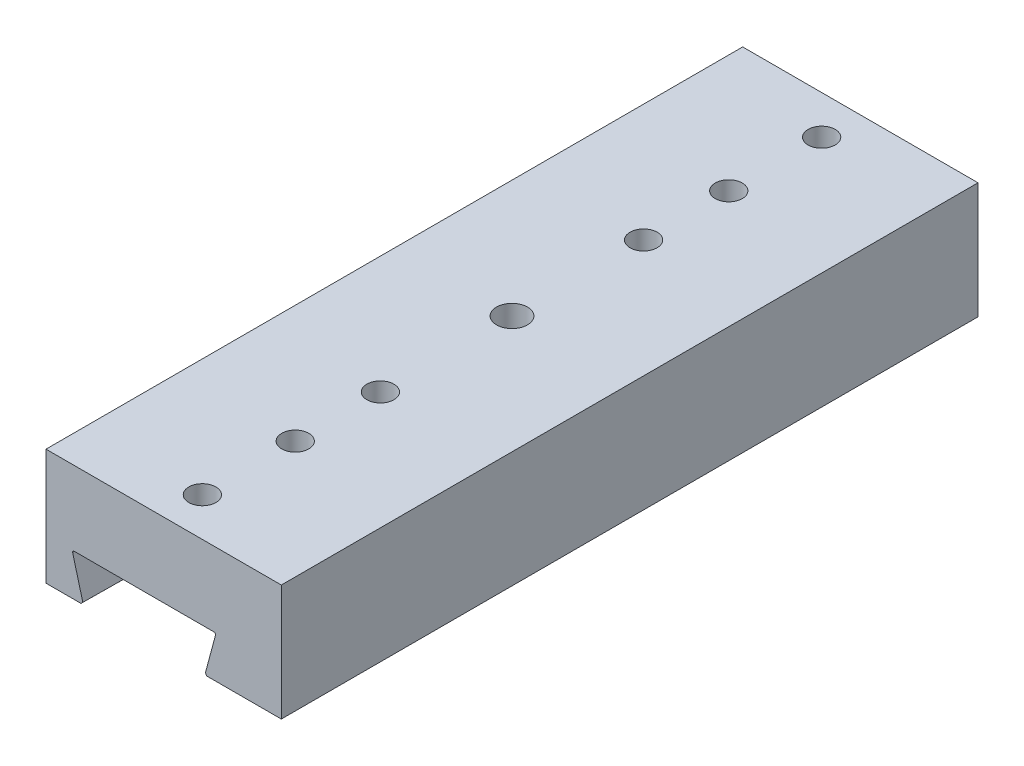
ISO-10303-21;
HEADER;
FILE_DESCRIPTION(('STEP AP214'),'2;1');
FILE_NAME('part.step','',(''),(''),'','','');
FILE_SCHEMA(('AUTOMOTIVE_DESIGN { 1 0 10303 214 1 1 1 1 }'));
ENDSEC;
DATA;
#1=APPLICATION_CONTEXT('core data for automotive mechanical design processes');
#2=APPLICATION_PROTOCOL_DEFINITION('international standard','automotive_design',2000,#1);
#3=PRODUCT_CONTEXT('',#1,'mechanical');
#4=PRODUCT('Part','Part','',(#3));
#5=PRODUCT_RELATED_PRODUCT_CATEGORY('part','',(#4));
#6=PRODUCT_DEFINITION_FORMATION('','',#4);
#7=PRODUCT_DEFINITION_CONTEXT('part definition',#1,'design');
#8=PRODUCT_DEFINITION('design','',#6,#7);
#9=PRODUCT_DEFINITION_SHAPE('','',#8);
#10=(LENGTH_UNIT() NAMED_UNIT(*) SI_UNIT(.MILLI.,.METRE.));
#11=(NAMED_UNIT(*) PLANE_ANGLE_UNIT() SI_UNIT($,.RADIAN.));
#12=(NAMED_UNIT(*) SI_UNIT($,.STERADIAN.) SOLID_ANGLE_UNIT());
#13=UNCERTAINTY_MEASURE_WITH_UNIT(LENGTH_MEASURE(1.E-05),#10,'distance_accuracy_value','');
#14=(GEOMETRIC_REPRESENTATION_CONTEXT(3) GLOBAL_UNCERTAINTY_ASSIGNED_CONTEXT((#13)) GLOBAL_UNIT_ASSIGNED_CONTEXT((#10,
#11,#12)) REPRESENTATION_CONTEXT('',''));
#15=CARTESIAN_POINT('',(0.,0.,0.));
#16=DIRECTION('',(0.,0.,1.));
#17=DIRECTION('',(1.,0.,0.));
#18=AXIS2_PLACEMENT_3D('',#15,#16,#17);
#19=CARTESIAN_POINT('',(-76.,-75.,225.));
#20=DIRECTION('',(0.,1.,0.));
#21=DIRECTION('',(0.,0.,1.));
#22=AXIS2_PLACEMENT_3D('',#19,#20,#21);
#23=PLANE('',#22);
#24=DIRECTION('',(1.,0.,0.));
#25=VECTOR('',#24,1.);
#26=CARTESIAN_POINT('',(-76.,-75.,225.));
#27=LINE('',#26,#25);
#28=CARTESIAN_POINT('',(27.8247448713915,-75.,225.));
#29=VERTEX_POINT('',#28);
#30=CARTESIAN_POINT('',(76.,-75.,225.));
#31=VERTEX_POINT('',#30);
#32=EDGE_CURVE('E144',#29,#31,#27,.T.);
#33=ORIENTED_EDGE('',*,*,#32,.F.);
#34=DIRECTION('',(0.,0.,-1.));
#35=VECTOR('',#34,1.);
#36=CARTESIAN_POINT('',(27.8247448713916,-75.,-225.));
#37=LINE('',#36,#35);
#38=CARTESIAN_POINT('',(27.8247448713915,-75.,-225.));
#39=VERTEX_POINT('',#38);
#40=EDGE_CURVE('E283',#29,#39,#37,.T.);
#41=ORIENTED_EDGE('',*,*,#40,.T.);
#42=DIRECTION('',(1.,0.,0.));
#43=VECTOR('',#42,1.);
#44=CARTESIAN_POINT('',(-76.,-75.,-225.));
#45=LINE('',#44,#43);
#46=CARTESIAN_POINT('',(76.,-75.,-225.));
#47=VERTEX_POINT('',#46);
#48=EDGE_CURVE('E173',#39,#47,#45,.T.);
#49=ORIENTED_EDGE('',*,*,#48,.T.);
#50=DIRECTION('',(0.,0.,-1.));
#51=VECTOR('',#50,1.);
#52=CARTESIAN_POINT('',(76.,-75.,225.));
#53=LINE('',#52,#51);
#54=EDGE_CURVE('E160',#31,#47,#53,.T.);
#55=ORIENTED_EDGE('',*,*,#54,.F.);
#56=EDGE_LOOP('',(#33,#41,#49,#55));
#57=FACE_BOUND('',#56,.T.);
#58=ADVANCED_FACE('F43',(#57),#23,.F.);
#59=CARTESIAN_POINT('',(-76.,-75.,-225.));
#60=VERTEX_POINT('',#59);
#61=CARTESIAN_POINT('',(-48.9000749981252,-75.,-225.));
#62=VERTEX_POINT('',#61);
#63=EDGE_CURVE('E170',#60,#62,#45,.T.);
#64=ORIENTED_EDGE('',*,*,#63,.T.);
#65=DIRECTION('',(-0.00999950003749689,0.,0.999950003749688));
#66=VECTOR('',#65,1.);
#67=CARTESIAN_POINT('',(-53.3999250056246,-75.,224.985000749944));
#68=LINE('',#67,#66);
#69=CARTESIAN_POINT('',(-53.4000749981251,-75.,225.));
#70=VERTEX_POINT('',#69);
#71=EDGE_CURVE('E141',#62,#70,#68,.T.);
#72=ORIENTED_EDGE('',*,*,#71,.T.);
#73=CARTESIAN_POINT('',(-76.,-75.,225.));
#74=VERTEX_POINT('',#73);
#75=EDGE_CURVE('E133',#74,#70,#27,.T.);
#76=ORIENTED_EDGE('',*,*,#75,.F.);
#77=DIRECTION('',(0.,0.,-1.));
#78=VECTOR('',#77,1.);
#79=CARTESIAN_POINT('',(-76.,-75.,225.));
#80=LINE('',#79,#78);
#81=EDGE_CURVE('E138',#74,#60,#80,.T.);
#82=ORIENTED_EDGE('',*,*,#81,.T.);
#83=EDGE_LOOP('',(#64,#72,#76,#82));
#84=FACE_BOUND('',#83,.T.);
#85=ADVANCED_FACE('F136',(#84),#23,.F.);
#86=CARTESIAN_POINT('',(0.,0.,225.));
#87=DIRECTION('',(0.,0.,1.));
#88=DIRECTION('',(1.,0.,0.));
#89=AXIS2_PLACEMENT_3D('',#86,#87,#88);
#90=PLANE('',#89);
#91=ORIENTED_EDGE('',*,*,#75,.T.);
#92=DIRECTION('',(0.707124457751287,0.70708910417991,0.));
#93=VECTOR('',#92,1.);
#94=CARTESIAN_POINT('',(10.8012973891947,-10.801837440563,225.));
#95=LINE('',#94,#93);
#96=CARTESIAN_POINT('',(-52.2169906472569,-73.8169747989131,225.));
#97=VERTEX_POINT('',#96);
#98=EDGE_CURVE('E285',#70,#97,#95,.T.);
#99=ORIENTED_EDGE('',*,*,#98,.T.);
#100=DIRECTION('',(0.258819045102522,-0.965925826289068,0.));
#101=VECTOR('',#100,1.);
#102=CARTESIAN_POINT('',(-59.1346281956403,-48.,225.));
#103=LINE('',#102,#101);
#104=CARTESIAN_POINT('',(-58.7973318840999,-49.2588069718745,225.));
#105=VERTEX_POINT('',#104);
#106=EDGE_CURVE('E196',#105,#97,#103,.T.);
#107=ORIENTED_EDGE('',*,*,#106,.F.);
#108=CARTESIAN_POINT('',(-57.8313545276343,-49.,225.));
#109=DIRECTION('',(0.,0.,1.));
#110=DIRECTION('',(-1.,0.,0.));
#111=AXIS2_PLACEMENT_3D('',#108,#109,#110);
#112=ELLIPSE('',#111,1.00004999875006,1.);
#113=CARTESIAN_POINT('',(-57.8313545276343,-48.,225.));
#114=VERTEX_POINT('',#113);
#115=EDGE_CURVE('E228',#105,#114,#112,.F.);
#116=ORIENTED_EDGE('',*,*,#115,.T.);
#117=DIRECTION('',(-1.,0.,0.));
#118=VECTOR('',#117,1.);
#119=CARTESIAN_POINT('',(33.8346281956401,-48.,225.));
#120=LINE('',#119,#118);
#121=CARTESIAN_POINT('',(32.5314028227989,-48.,225.));
#122=VERTEX_POINT('',#121);
#123=EDGE_CURVE('E195',#122,#114,#120,.T.);
#124=ORIENTED_EDGE('',*,*,#123,.F.);
#125=CARTESIAN_POINT('',(32.5314028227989,-49.,225.));
#126=DIRECTION('',(0.,0.,1.));
#127=DIRECTION('',(1.,0.,0.));
#128=AXIS2_PLACEMENT_3D('',#125,#126,#127);
#129=CIRCLE('',#128,1.);
#130=CARTESIAN_POINT('',(33.497328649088,-49.2588190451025,225.));
#131=VERTEX_POINT('',#130);
#132=EDGE_CURVE('E222',#122,#131,#129,.F.);
#133=ORIENTED_EDGE('',*,*,#132,.T.);
#134=DIRECTION('',(0.258819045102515,0.96592582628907,0.));
#135=VECTOR('',#134,1.);
#136=CARTESIAN_POINT('',(26.6,-75.,225.));
#137=LINE('',#136,#135);
#138=CARTESIAN_POINT('',(26.9882285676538,-73.5511112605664,225.));
#139=VERTEX_POINT('',#138);
#140=EDGE_CURVE('E192',#139,#131,#137,.T.);
#141=ORIENTED_EDGE('',*,*,#140,.F.);
#142=DIRECTION('',(0.500000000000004,-0.866025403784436,0.));
#143=VECTOR('',#142,1.);
#144=CARTESIAN_POINT('',(-11.6073939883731,-6.7015320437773,225.));
#145=LINE('',#144,#143);
#146=EDGE_CURVE('E58',#139,#29,#145,.T.);
#147=ORIENTED_EDGE('',*,*,#146,.T.);
#148=ORIENTED_EDGE('',*,*,#32,.T.);
#149=DIRECTION('',(0.,1.,0.));
#150=VECTOR('',#149,1.);
#151=CARTESIAN_POINT('',(76.,0.,225.));
#152=LINE('',#151,#150);
#153=CARTESIAN_POINT('',(76.,0.,225.));
#154=VERTEX_POINT('',#153);
#155=EDGE_CURVE('E143',#31,#154,#152,.T.);
#156=ORIENTED_EDGE('',*,*,#155,.T.);
#157=DIRECTION('',(-1.,0.,0.));
#158=VECTOR('',#157,1.);
#159=CARTESIAN_POINT('',(-76.,0.,225.));
#160=LINE('',#159,#158);
#161=CARTESIAN_POINT('',(-76.,0.,225.));
#162=VERTEX_POINT('',#161);
#163=EDGE_CURVE('E150',#154,#162,#160,.T.);
#164=ORIENTED_EDGE('',*,*,#163,.T.);
#165=DIRECTION('',(0.,-1.,0.));
#166=VECTOR('',#165,1.);
#167=CARTESIAN_POINT('',(-76.,0.,225.));
#168=LINE('',#167,#166);
#169=EDGE_CURVE('E147',#162,#74,#168,.T.);
#170=ORIENTED_EDGE('',*,*,#169,.T.);
#171=EDGE_LOOP('',(#91,#99,#107,#116,#124,#133,#141,#147,#148,#156,#164,#170));
#172=FACE_BOUND('',#171,.T.);
#173=ADVANCED_FACE('F148',(#172),#90,.T.);
#174=CARTESIAN_POINT('',(0.,0.,-225.));
#175=DIRECTION('',(0.,0.,1.));
#176=DIRECTION('',(1.,0.,0.));
#177=AXIS2_PLACEMENT_3D('',#174,#175,#176);
#178=PLANE('',#177);
#179=DIRECTION('',(-0.258819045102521,0.965925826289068,0.));
#180=VECTOR('',#179,1.);
#181=CARTESIAN_POINT('',(-54.6346281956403,-48.,-225.));
#182=LINE('',#181,#180);
#183=CARTESIAN_POINT('',(-47.7169906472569,-73.8169747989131,-225.));
#184=VERTEX_POINT('',#183);
#185=CARTESIAN_POINT('',(-54.2973318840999,-49.2588069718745,-225.));
#186=VERTEX_POINT('',#185);
#187=EDGE_CURVE('E206',#184,#186,#182,.T.);
#188=ORIENTED_EDGE('',*,*,#187,.F.);
#189=DIRECTION('',(-0.707124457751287,-0.70708910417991,0.));
#190=VECTOR('',#189,1.);
#191=CARTESIAN_POINT('',(-48.8395486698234,-74.9394766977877,-225.));
#192=LINE('',#191,#190);
#193=EDGE_CURVE('E189',#184,#62,#192,.T.);
#194=ORIENTED_EDGE('',*,*,#193,.T.);
#195=ORIENTED_EDGE('',*,*,#63,.F.);
#196=DIRECTION('',(0.,-1.,0.));
#197=VECTOR('',#196,1.);
#198=CARTESIAN_POINT('',(-76.,0.,-225.));
#199=LINE('',#198,#197);
#200=CARTESIAN_POINT('',(-76.,0.,-225.));
#201=VERTEX_POINT('',#200);
#202=EDGE_CURVE('E158',#201,#60,#199,.T.);
#203=ORIENTED_EDGE('',*,*,#202,.F.);
#204=DIRECTION('',(-1.,0.,0.));
#205=VECTOR('',#204,1.);
#206=CARTESIAN_POINT('',(-76.,0.,-225.));
#207=LINE('',#206,#205);
#208=CARTESIAN_POINT('',(76.,0.,-225.));
#209=VERTEX_POINT('',#208);
#210=EDGE_CURVE('E154',#209,#201,#207,.T.);
#211=ORIENTED_EDGE('',*,*,#210,.F.);
#212=DIRECTION('',(0.,1.,0.));
#213=VECTOR('',#212,1.);
#214=CARTESIAN_POINT('',(76.,0.,-225.));
#215=LINE('',#214,#213);
#216=EDGE_CURVE('E172',#47,#209,#215,.T.);
#217=ORIENTED_EDGE('',*,*,#216,.F.);
#218=ORIENTED_EDGE('',*,*,#48,.F.);
#219=DIRECTION('',(-0.500000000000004,0.866025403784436,0.));
#220=VECTOR('',#219,1.);
#221=CARTESIAN_POINT('',(27.8247448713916,-75.,-225.));
#222=LINE('',#221,#220);
#223=CARTESIAN_POINT('',(26.9882285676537,-73.5511112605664,-225.));
#224=VERTEX_POINT('',#223);
#225=EDGE_CURVE('E187',#39,#224,#222,.T.);
#226=ORIENTED_EDGE('',*,*,#225,.T.);
#227=DIRECTION('',(-0.258819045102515,-0.96592582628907,0.));
#228=VECTOR('',#227,1.);
#229=CARTESIAN_POINT('',(26.6,-75.,-225.));
#230=LINE('',#229,#228);
#231=CARTESIAN_POINT('',(33.497328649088,-49.2588190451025,-225.));
#232=VERTEX_POINT('',#231);
#233=EDGE_CURVE('E203',#232,#224,#230,.T.);
#234=ORIENTED_EDGE('',*,*,#233,.F.);
#235=CARTESIAN_POINT('',(32.5314028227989,-49.,-225.));
#236=DIRECTION('',(0.,0.,1.));
#237=DIRECTION('',(1.,0.,0.));
#238=AXIS2_PLACEMENT_3D('',#235,#236,#237);
#239=CIRCLE('',#238,1.);
#240=CARTESIAN_POINT('',(32.5314028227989,-48.,-225.));
#241=VERTEX_POINT('',#240);
#242=EDGE_CURVE('E220',#232,#241,#239,.T.);
#243=ORIENTED_EDGE('',*,*,#242,.T.);
#244=DIRECTION('',(1.,0.,0.));
#245=VECTOR('',#244,1.);
#246=CARTESIAN_POINT('',(33.8346281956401,-48.,-225.));
#247=LINE('',#246,#245);
#248=CARTESIAN_POINT('',(-53.3313545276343,-48.,-225.));
#249=VERTEX_POINT('',#248);
#250=EDGE_CURVE('E205',#249,#241,#247,.T.);
#251=ORIENTED_EDGE('',*,*,#250,.F.);
#252=CARTESIAN_POINT('',(-53.3313545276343,-49.,-225.));
#253=DIRECTION('',(0.,0.,1.));
#254=DIRECTION('',(-1.,0.,0.));
#255=AXIS2_PLACEMENT_3D('',#252,#253,#254);
#256=ELLIPSE('',#255,1.00004999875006,1.);
#257=EDGE_CURVE('E225',#249,#186,#256,.T.);
#258=ORIENTED_EDGE('',*,*,#257,.T.);
#259=EDGE_LOOP('',(#188,#194,#195,#203,#211,#217,#218,#226,#234,#243,#251,#258));
#260=FACE_BOUND('',#259,.T.);
#261=ADVANCED_FACE('F260',(#260),#178,.F.);
#262=CARTESIAN_POINT('',(-76.,0.,225.));
#263=DIRECTION('',(1.,0.,0.));
#264=DIRECTION('',(0.,1.,0.));
#265=AXIS2_PLACEMENT_3D('',#262,#263,#264);
#266=PLANE('',#265);
#267=ORIENTED_EDGE('',*,*,#202,.T.);
#268=ORIENTED_EDGE('',*,*,#81,.F.);
#269=ORIENTED_EDGE('',*,*,#169,.F.);
#270=DIRECTION('',(0.,0.,-1.));
#271=VECTOR('',#270,1.);
#272=CARTESIAN_POINT('',(-76.,0.,225.));
#273=LINE('',#272,#271);
#274=EDGE_CURVE('E246',#162,#201,#273,.T.);
#275=ORIENTED_EDGE('',*,*,#274,.T.);
#276=EDGE_LOOP('',(#267,#268,#269,#275));
#277=FACE_BOUND('',#276,.T.);
#278=ADVANCED_FACE('F156',(#277),#266,.F.);
#279=CARTESIAN_POINT('',(76.,0.,225.));
#280=DIRECTION('',(-1.,0.,0.));
#281=DIRECTION('',(0.,-1.,0.));
#282=AXIS2_PLACEMENT_3D('',#279,#280,#281);
#283=PLANE('',#282);
#284=ORIENTED_EDGE('',*,*,#216,.T.);
#285=DIRECTION('',(0.,0.,-1.));
#286=VECTOR('',#285,1.);
#287=CARTESIAN_POINT('',(76.,0.,225.));
#288=LINE('',#287,#286);
#289=EDGE_CURVE('E166',#154,#209,#288,.T.);
#290=ORIENTED_EDGE('',*,*,#289,.F.);
#291=ORIENTED_EDGE('',*,*,#155,.F.);
#292=ORIENTED_EDGE('',*,*,#54,.T.);
#293=EDGE_LOOP('',(#284,#290,#291,#292));
#294=FACE_BOUND('',#293,.T.);
#295=ADVANCED_FACE('F254',(#294),#283,.F.);
#296=CARTESIAN_POINT('',(-76.,0.,225.));
#297=DIRECTION('',(0.,-1.,0.));
#298=DIRECTION('',(0.,0.,-1.));
#299=AXIS2_PLACEMENT_3D('',#296,#297,#298);
#300=PLANE('',#299);
#301=CARTESIAN_POINT('',(0.,0.,0.));
#302=DIRECTION('',(0.,-1.,0.));
#303=DIRECTION('',(0.,0.,-1.));
#304=AXIS2_PLACEMENT_3D('',#301,#302,#303);
#305=CIRCLE('',#304,10.);
#306=CARTESIAN_POINT('',(0.,0.,-10.));
#307=VERTEX_POINT('',#306);
#308=EDGE_CURVE('E351',#307,#307,#305,.F.);
#309=ORIENTED_EDGE('',*,*,#308,.F.);
#310=EDGE_LOOP('',(#309));
#311=FACE_BOUND('',#310,.T.);
#312=CARTESIAN_POINT('',(0.,0.,85.));
#313=DIRECTION('',(0.,-1.,0.));
#314=DIRECTION('',(0.,0.,-1.));
#315=AXIS2_PLACEMENT_3D('',#312,#313,#314);
#316=CIRCLE('',#315,8.74999999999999);
#317=CARTESIAN_POINT('',(0.,0.,76.25));
#318=VERTEX_POINT('',#317);
#319=EDGE_CURVE('E355',#318,#318,#316,.T.);
#320=ORIENTED_EDGE('',*,*,#319,.T.);
#321=EDGE_LOOP('',(#320));
#322=FACE_BOUND('',#321,.T.);
#323=CARTESIAN_POINT('',(0.,0.,140.));
#324=DIRECTION('',(0.,-1.,0.));
#325=DIRECTION('',(0.,0.,-1.));
#326=AXIS2_PLACEMENT_3D('',#323,#324,#325);
#327=CIRCLE('',#326,8.74999999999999);
#328=CARTESIAN_POINT('',(0.,0.,131.25));
#329=VERTEX_POINT('',#328);
#330=EDGE_CURVE('E359',#329,#329,#327,.T.);
#331=ORIENTED_EDGE('',*,*,#330,.T.);
#332=EDGE_LOOP('',(#331));
#333=FACE_BOUND('',#332,.T.);
#334=CARTESIAN_POINT('',(0.,0.,200.));
#335=DIRECTION('',(0.,-1.,0.));
#336=DIRECTION('',(0.,0.,-1.));
#337=AXIS2_PLACEMENT_3D('',#334,#335,#336);
#338=CIRCLE('',#337,8.74999999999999);
#339=CARTESIAN_POINT('',(0.,0.,191.25));
#340=VERTEX_POINT('',#339);
#341=EDGE_CURVE('E363',#340,#340,#338,.T.);
#342=ORIENTED_EDGE('',*,*,#341,.T.);
#343=EDGE_LOOP('',(#342));
#344=FACE_BOUND('',#343,.T.);
#345=CARTESIAN_POINT('',(0.,0.,-200.));
#346=DIRECTION('',(0.,-1.,0.));
#347=DIRECTION('',(0.,0.,-1.));
#348=AXIS2_PLACEMENT_3D('',#345,#346,#347);
#349=CIRCLE('',#348,8.74999999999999);
#350=CARTESIAN_POINT('',(0.,0.,-208.75));
#351=VERTEX_POINT('',#350);
#352=EDGE_CURVE('E367',#351,#351,#349,.T.);
#353=ORIENTED_EDGE('',*,*,#352,.T.);
#354=EDGE_LOOP('',(#353));
#355=FACE_BOUND('',#354,.T.);
#356=CARTESIAN_POINT('',(0.,0.,-140.));
#357=DIRECTION('',(0.,-1.,0.));
#358=DIRECTION('',(0.,0.,-1.));
#359=AXIS2_PLACEMENT_3D('',#356,#357,#358);
#360=CIRCLE('',#359,8.74999999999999);
#361=CARTESIAN_POINT('',(0.,0.,-148.75));
#362=VERTEX_POINT('',#361);
#363=EDGE_CURVE('E370',#362,#362,#360,.T.);
#364=ORIENTED_EDGE('',*,*,#363,.T.);
#365=EDGE_LOOP('',(#364));
#366=FACE_BOUND('',#365,.T.);
#367=CARTESIAN_POINT('',(0.,0.,-85.));
#368=DIRECTION('',(0.,-1.,0.));
#369=DIRECTION('',(0.,0.,-1.));
#370=AXIS2_PLACEMENT_3D('',#367,#368,#369);
#371=CIRCLE('',#370,8.74999999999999);
#372=CARTESIAN_POINT('',(0.,0.,-93.75));
#373=VERTEX_POINT('',#372);
#374=EDGE_CURVE('E229',#373,#373,#371,.T.);
#375=ORIENTED_EDGE('',*,*,#374,.T.);
#376=EDGE_LOOP('',(#375));
#377=FACE_BOUND('',#376,.T.);
#378=ORIENTED_EDGE('',*,*,#210,.T.);
#379=ORIENTED_EDGE('',*,*,#274,.F.);
#380=ORIENTED_EDGE('',*,*,#163,.F.);
#381=ORIENTED_EDGE('',*,*,#289,.T.);
#382=EDGE_LOOP('',(#378,#379,#380,#381));
#383=FACE_BOUND('',#382,.T.);
#384=ADVANCED_FACE('F259',(#311,#322,#333,#344,#355,#366,#377,#383),#300,.F.);
#385=CARTESIAN_POINT('',(43.5681378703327,-11.6740473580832,0.));
#386=DIRECTION('',(-0.96592582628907,0.258819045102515,0.));
#387=DIRECTION('',(-0.258819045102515,-0.96592582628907,0.));
#388=AXIS2_PLACEMENT_3D('',#385,#386,#387);
#389=PLANE('',#388);
#390=ORIENTED_EDGE('',*,*,#233,.T.);
#391=DIRECTION('',(0.,0.,1.));
#392=VECTOR('',#391,1.);
#393=CARTESIAN_POINT('',(26.9882285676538,-73.5511112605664,225.));
#394=LINE('',#393,#392);
#395=EDGE_CURVE('E66',#224,#139,#394,.T.);
#396=ORIENTED_EDGE('',*,*,#395,.T.);
#397=ORIENTED_EDGE('',*,*,#140,.T.);
#398=DIRECTION('',(0.,0.,-1.));
#399=VECTOR('',#398,1.);
#400=CARTESIAN_POINT('',(33.497328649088,-49.2588190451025,-225.));
#401=LINE('',#400,#399);
#402=EDGE_CURVE('E159',#131,#232,#401,.T.);
#403=ORIENTED_EDGE('',*,*,#402,.T.);
#404=EDGE_LOOP('',(#390,#396,#397,#403));
#405=FACE_BOUND('',#404,.T.);
#406=ADVANCED_FACE('F278',(#405),#389,.T.);
#407=CARTESIAN_POINT('',(0.,-48.,0.));
#408=DIRECTION('',(0.,-1.,0.));
#409=DIRECTION('',(0.,0.,-1.));
#410=AXIS2_PLACEMENT_3D('',#407,#408,#409);
#411=PLANE('',#410);
#412=CARTESIAN_POINT('',(0.,-48.,0.));
#413=DIRECTION('',(0.,-1.,0.));
#414=DIRECTION('',(0.,0.,-1.));
#415=AXIS2_PLACEMENT_3D('',#412,#413,#414);
#416=CIRCLE('',#415,11.0000000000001);
#417=CARTESIAN_POINT('',(0.,-48.,-11.0000000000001));
#418=VERTEX_POINT('',#417);
#419=EDGE_CURVE('E12',#418,#418,#416,.F.);
#420=ORIENTED_EDGE('',*,*,#419,.T.);
#421=EDGE_LOOP('',(#420));
#422=FACE_BOUND('',#421,.T.);
#423=CARTESIAN_POINT('',(0.,-48.,85.));
#424=DIRECTION('',(0.,-1.,0.));
#425=DIRECTION('',(0.,0.,-1.));
#426=AXIS2_PLACEMENT_3D('',#423,#424,#425);
#427=CIRCLE('',#426,15.);
#428=CARTESIAN_POINT('',(0.,-48.,70.));
#429=VERTEX_POINT('',#428);
#430=EDGE_CURVE('E655',#429,#429,#427,.T.);
#431=ORIENTED_EDGE('',*,*,#430,.F.);
#432=EDGE_LOOP('',(#431));
#433=FACE_BOUND('',#432,.T.);
#434=CARTESIAN_POINT('',(0.,-48.,140.));
#435=DIRECTION('',(0.,-1.,0.));
#436=DIRECTION('',(0.,0.,-1.));
#437=AXIS2_PLACEMENT_3D('',#434,#435,#436);
#438=CIRCLE('',#437,15.);
#439=CARTESIAN_POINT('',(0.,-48.,125.));
#440=VERTEX_POINT('',#439);
#441=EDGE_CURVE('E665',#440,#440,#438,.T.);
#442=ORIENTED_EDGE('',*,*,#441,.F.);
#443=EDGE_LOOP('',(#442));
#444=FACE_BOUND('',#443,.T.);
#445=CARTESIAN_POINT('',(0.,-48.,200.));
#446=DIRECTION('',(0.,-1.,0.));
#447=DIRECTION('',(0.,0.,-1.));
#448=AXIS2_PLACEMENT_3D('',#445,#446,#447);
#449=CIRCLE('',#448,15.);
#450=CARTESIAN_POINT('',(0.,-48.,185.));
#451=VERTEX_POINT('',#450);
#452=EDGE_CURVE('E675',#451,#451,#449,.T.);
#453=ORIENTED_EDGE('',*,*,#452,.F.);
#454=EDGE_LOOP('',(#453));
#455=FACE_BOUND('',#454,.T.);
#456=CARTESIAN_POINT('',(0.,-48.,-200.));
#457=DIRECTION('',(0.,-1.,0.));
#458=DIRECTION('',(0.,0.,-1.));
#459=AXIS2_PLACEMENT_3D('',#456,#457,#458);
#460=CIRCLE('',#459,15.);
#461=CARTESIAN_POINT('',(0.,-48.,-215.));
#462=VERTEX_POINT('',#461);
#463=EDGE_CURVE('E685',#462,#462,#460,.T.);
#464=ORIENTED_EDGE('',*,*,#463,.F.);
#465=EDGE_LOOP('',(#464));
#466=FACE_BOUND('',#465,.T.);
#467=CARTESIAN_POINT('',(0.,-48.,-140.));
#468=DIRECTION('',(0.,-1.,0.));
#469=DIRECTION('',(0.,0.,-1.));
#470=AXIS2_PLACEMENT_3D('',#467,#468,#469);
#471=CIRCLE('',#470,15.);
#472=CARTESIAN_POINT('',(0.,-48.,-155.));
#473=VERTEX_POINT('',#472);
#474=EDGE_CURVE('E695',#473,#473,#471,.T.);
#475=ORIENTED_EDGE('',*,*,#474,.F.);
#476=EDGE_LOOP('',(#475));
#477=FACE_BOUND('',#476,.T.);
#478=CARTESIAN_POINT('',(0.,-48.,-85.));
#479=DIRECTION('',(0.,-1.,0.));
#480=DIRECTION('',(0.,0.,-1.));
#481=AXIS2_PLACEMENT_3D('',#478,#479,#480);
#482=CIRCLE('',#481,15.);
#483=CARTESIAN_POINT('',(0.,-48.,-100.));
#484=VERTEX_POINT('',#483);
#485=EDGE_CURVE('E372',#484,#484,#482,.T.);
#486=ORIENTED_EDGE('',*,*,#485,.F.);
#487=EDGE_LOOP('',(#486));
#488=FACE_BOUND('',#487,.T.);
#489=ORIENTED_EDGE('',*,*,#250,.T.);
#490=DIRECTION('',(0.,0.,-1.));
#491=VECTOR('',#490,1.);
#492=CARTESIAN_POINT('',(32.5314028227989,-48.,225.));
#493=LINE('',#492,#491);
#494=EDGE_CURVE('E216',#241,#122,#493,.F.);
#495=ORIENTED_EDGE('',*,*,#494,.T.);
#496=ORIENTED_EDGE('',*,*,#123,.T.);
#497=DIRECTION('',(0.00999950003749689,0.,-0.999950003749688));
#498=VECTOR('',#497,1.);
#499=CARTESIAN_POINT('',(-53.3314848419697,-48.,-224.986968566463));
#500=LINE('',#499,#498);
#501=EDGE_CURVE('E163',#114,#249,#500,.T.);
#502=ORIENTED_EDGE('',*,*,#501,.T.);
#503=EDGE_LOOP('',(#489,#495,#496,#502));
#504=FACE_BOUND('',#503,.T.);
#505=ADVANCED_FACE('F270',(#422,#433,#444,#455,#466,#477,#488,#504),#411,.T.);
#506=CARTESIAN_POINT('',(-65.0680097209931,-17.4349206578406,-0.650680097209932));
#507=DIRECTION('',(0.965880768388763,0.258806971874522,0.00965880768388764));
#508=DIRECTION('',(-0.258819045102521,0.965925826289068,0.));
#509=AXIS2_PLACEMENT_3D('',#506,#507,#508);
#510=PLANE('',#509);
#511=ORIENTED_EDGE('',*,*,#106,.T.);
#512=DIRECTION('',(0.00999950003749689,0.,-0.999950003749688));
#513=VECTOR('',#512,1.);
#514=CARTESIAN_POINT('',(-47.7169589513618,-73.8169747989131,-225.003169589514));
#515=LINE('',#514,#513);
#516=EDGE_CURVE('E185',#97,#184,#515,.T.);
#517=ORIENTED_EDGE('',*,*,#516,.T.);
#518=ORIENTED_EDGE('',*,*,#187,.T.);
#519=DIRECTION('',(0.00999950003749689,0.,-0.999950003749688));
#520=VECTOR('',#519,1.);
#521=CARTESIAN_POINT('',(-58.7973656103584,-49.2588069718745,225.003372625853));
#522=LINE('',#521,#520);
#523=EDGE_CURVE('E218',#186,#105,#522,.F.);
#524=ORIENTED_EDGE('',*,*,#523,.T.);
#525=EDGE_LOOP('',(#511,#517,#518,#524));
#526=FACE_BOUND('',#525,.T.);
#527=ADVANCED_FACE('F323',(#526),#510,.T.);
#528=CARTESIAN_POINT('',(0.,-48.,-85.));
#529=DIRECTION('',(0.,-1.,0.));
#530=DIRECTION('',(0.,0.,-1.));
#531=AXIS2_PLACEMENT_3D('',#528,#529,#530);
#532=CYLINDRICAL_SURFACE('',#531,8.75);
#533=ORIENTED_EDGE('',*,*,#374,.F.);
#534=EDGE_LOOP('',(#533));
#535=FACE_BOUND('',#534,.T.);
#536=CARTESIAN_POINT('',(0.,-27.4,-85.));
#537=DIRECTION('',(0.,-1.,0.));
#538=DIRECTION('',(0.,0.,-1.));
#539=AXIS2_PLACEMENT_3D('',#536,#537,#538);
#540=CIRCLE('',#539,8.75);
#541=CARTESIAN_POINT('',(0.,-27.4,-93.75));
#542=VERTEX_POINT('',#541);
#543=EDGE_CURVE('E235',#542,#542,#540,.T.);
#544=ORIENTED_EDGE('',*,*,#543,.T.);
#545=EDGE_LOOP('',(#544));
#546=FACE_BOUND('',#545,.T.);
#547=ADVANCED_FACE('F326',(#535,#546),#532,.F.);
#548=CARTESIAN_POINT('',(8.75,-27.4,-85.));
#549=DIRECTION('',(0.,1.,0.));
#550=DIRECTION('',(0.,0.,1.));
#551=AXIS2_PLACEMENT_3D('',#548,#549,#550);
#552=PLANE('',#551);
#553=ORIENTED_EDGE('',*,*,#543,.F.);
#554=EDGE_LOOP('',(#553));
#555=FACE_BOUND('',#554,.T.);
#556=CARTESIAN_POINT('',(0.,-27.4,-85.));
#557=DIRECTION('',(0.,-1.,0.));
#558=DIRECTION('',(0.,0.,-1.));
#559=AXIS2_PLACEMENT_3D('',#556,#557,#558);
#560=CIRCLE('',#559,15.);
#561=CARTESIAN_POINT('',(0.,-27.4,-100.));
#562=VERTEX_POINT('',#561);
#563=EDGE_CURVE('E240',#562,#562,#560,.T.);
#564=ORIENTED_EDGE('',*,*,#563,.T.);
#565=EDGE_LOOP('',(#564));
#566=FACE_BOUND('',#565,.T.);
#567=ADVANCED_FACE('F332',(#555,#566),#552,.F.);
#568=CARTESIAN_POINT('',(0.,-48.,-85.));
#569=DIRECTION('',(0.,-1.,0.));
#570=DIRECTION('',(0.,0.,-1.));
#571=AXIS2_PLACEMENT_3D('',#568,#569,#570);
#572=CYLINDRICAL_SURFACE('',#571,15.);
#573=ORIENTED_EDGE('',*,*,#563,.F.);
#574=EDGE_LOOP('',(#573));
#575=FACE_BOUND('',#574,.T.);
#576=ORIENTED_EDGE('',*,*,#485,.T.);
#577=EDGE_LOOP('',(#576));
#578=FACE_BOUND('',#577,.T.);
#579=ADVANCED_FACE('F385',(#575,#578),#572,.F.);
#580=CARTESIAN_POINT('',(0.,-48.,-140.));
#581=DIRECTION('',(0.,-1.,0.));
#582=DIRECTION('',(0.,0.,-1.));
#583=AXIS2_PLACEMENT_3D('',#580,#581,#582);
#584=CYLINDRICAL_SURFACE('',#583,8.75);
#585=ORIENTED_EDGE('',*,*,#363,.F.);
#586=EDGE_LOOP('',(#585));
#587=FACE_BOUND('',#586,.T.);
#588=CARTESIAN_POINT('',(0.,-27.4,-140.));
#589=DIRECTION('',(0.,-1.,0.));
#590=DIRECTION('',(0.,0.,-1.));
#591=AXIS2_PLACEMENT_3D('',#588,#589,#590);
#592=CIRCLE('',#591,8.75);
#593=CARTESIAN_POINT('',(0.,-27.4,-148.75));
#594=VERTEX_POINT('',#593);
#595=EDGE_CURVE('E373',#594,#594,#592,.T.);
#596=ORIENTED_EDGE('',*,*,#595,.T.);
#597=EDGE_LOOP('',(#596));
#598=FACE_BOUND('',#597,.T.);
#599=ADVANCED_FACE('F388',(#587,#598),#584,.F.);
#600=CARTESIAN_POINT('',(8.75,-27.4,-140.));
#601=DIRECTION('',(0.,1.,0.));
#602=DIRECTION('',(0.,0.,1.));
#603=AXIS2_PLACEMENT_3D('',#600,#601,#602);
#604=PLANE('',#603);
#605=ORIENTED_EDGE('',*,*,#595,.F.);
#606=EDGE_LOOP('',(#605));
#607=FACE_BOUND('',#606,.T.);
#608=CARTESIAN_POINT('',(0.,-27.4,-140.));
#609=DIRECTION('',(0.,-1.,0.));
#610=DIRECTION('',(0.,0.,-1.));
#611=AXIS2_PLACEMENT_3D('',#608,#609,#610);
#612=CIRCLE('',#611,15.);
#613=CARTESIAN_POINT('',(0.,-27.4,-155.));
#614=VERTEX_POINT('',#613);
#615=EDGE_CURVE('E378',#614,#614,#612,.T.);
#616=ORIENTED_EDGE('',*,*,#615,.T.);
#617=EDGE_LOOP('',(#616));
#618=FACE_BOUND('',#617,.T.);
#619=ADVANCED_FACE('F396',(#607,#618),#604,.F.);
#620=CARTESIAN_POINT('',(0.,-48.,-140.));
#621=DIRECTION('',(0.,-1.,0.));
#622=DIRECTION('',(0.,0.,-1.));
#623=AXIS2_PLACEMENT_3D('',#620,#621,#622);
#624=CYLINDRICAL_SURFACE('',#623,15.);
#625=ORIENTED_EDGE('',*,*,#615,.F.);
#626=EDGE_LOOP('',(#625));
#627=FACE_BOUND('',#626,.T.);
#628=ORIENTED_EDGE('',*,*,#474,.T.);
#629=EDGE_LOOP('',(#628));
#630=FACE_BOUND('',#629,.T.);
#631=ADVANCED_FACE('F403',(#627,#630),#624,.F.);
#632=CARTESIAN_POINT('',(0.,-48.,-200.));
#633=DIRECTION('',(0.,-1.,0.));
#634=DIRECTION('',(0.,0.,-1.));
#635=AXIS2_PLACEMENT_3D('',#632,#633,#634);
#636=CYLINDRICAL_SURFACE('',#635,8.75);
#637=ORIENTED_EDGE('',*,*,#352,.F.);
#638=EDGE_LOOP('',(#637));
#639=FACE_BOUND('',#638,.T.);
#640=CARTESIAN_POINT('',(0.,-27.4,-200.));
#641=DIRECTION('',(0.,-1.,0.));
#642=DIRECTION('',(0.,0.,-1.));
#643=AXIS2_PLACEMENT_3D('',#640,#641,#642);
#644=CIRCLE('',#643,8.75);
#645=CARTESIAN_POINT('',(0.,-27.4,-208.75));
#646=VERTEX_POINT('',#645);
#647=EDGE_CURVE('E691',#646,#646,#644,.T.);
#648=ORIENTED_EDGE('',*,*,#647,.T.);
#649=EDGE_LOOP('',(#648));
#650=FACE_BOUND('',#649,.T.);
#651=ADVANCED_FACE('F407',(#639,#650),#636,.F.);
#652=CARTESIAN_POINT('',(8.75,-27.4,-200.));
#653=DIRECTION('',(0.,1.,0.));
#654=DIRECTION('',(0.,0.,1.));
#655=AXIS2_PLACEMENT_3D('',#652,#653,#654);
#656=PLANE('',#655);
#657=ORIENTED_EDGE('',*,*,#647,.F.);
#658=EDGE_LOOP('',(#657));
#659=FACE_BOUND('',#658,.T.);
#660=CARTESIAN_POINT('',(0.,-27.4,-200.));
#661=DIRECTION('',(0.,-1.,0.));
#662=DIRECTION('',(0.,0.,-1.));
#663=AXIS2_PLACEMENT_3D('',#660,#661,#662);
#664=CIRCLE('',#663,15.);
#665=CARTESIAN_POINT('',(0.,-27.4,-215.));
#666=VERTEX_POINT('',#665);
#667=EDGE_CURVE('E688',#666,#666,#664,.T.);
#668=ORIENTED_EDGE('',*,*,#667,.T.);
#669=EDGE_LOOP('',(#668));
#670=FACE_BOUND('',#669,.T.);
#671=ADVANCED_FACE('F411',(#659,#670),#656,.F.);
#672=CARTESIAN_POINT('',(0.,-48.,-200.));
#673=DIRECTION('',(0.,-1.,0.));
#674=DIRECTION('',(0.,0.,-1.));
#675=AXIS2_PLACEMENT_3D('',#672,#673,#674);
#676=CYLINDRICAL_SURFACE('',#675,15.);
#677=ORIENTED_EDGE('',*,*,#667,.F.);
#678=EDGE_LOOP('',(#677));
#679=FACE_BOUND('',#678,.T.);
#680=ORIENTED_EDGE('',*,*,#463,.T.);
#681=EDGE_LOOP('',(#680));
#682=FACE_BOUND('',#681,.T.);
#683=ADVANCED_FACE('F415',(#679,#682),#676,.F.);
#684=CARTESIAN_POINT('',(0.,-48.,200.));
#685=DIRECTION('',(0.,-1.,0.));
#686=DIRECTION('',(0.,0.,-1.));
#687=AXIS2_PLACEMENT_3D('',#684,#685,#686);
#688=CYLINDRICAL_SURFACE('',#687,8.75);
#689=ORIENTED_EDGE('',*,*,#341,.F.);
#690=EDGE_LOOP('',(#689));
#691=FACE_BOUND('',#690,.T.);
#692=CARTESIAN_POINT('',(0.,-27.4,200.));
#693=DIRECTION('',(0.,-1.,0.));
#694=DIRECTION('',(0.,0.,-1.));
#695=AXIS2_PLACEMENT_3D('',#692,#693,#694);
#696=CIRCLE('',#695,8.75);
#697=CARTESIAN_POINT('',(0.,-27.4,191.25));
#698=VERTEX_POINT('',#697);
#699=EDGE_CURVE('E681',#698,#698,#696,.T.);
#700=ORIENTED_EDGE('',*,*,#699,.T.);
#701=EDGE_LOOP('',(#700));
#702=FACE_BOUND('',#701,.T.);
#703=ADVANCED_FACE('F419',(#691,#702),#688,.F.);
#704=CARTESIAN_POINT('',(8.75,-27.4,200.));
#705=DIRECTION('',(0.,1.,0.));
#706=DIRECTION('',(0.,0.,1.));
#707=AXIS2_PLACEMENT_3D('',#704,#705,#706);
#708=PLANE('',#707);
#709=ORIENTED_EDGE('',*,*,#699,.F.);
#710=EDGE_LOOP('',(#709));
#711=FACE_BOUND('',#710,.T.);
#712=CARTESIAN_POINT('',(0.,-27.4,200.));
#713=DIRECTION('',(0.,-1.,0.));
#714=DIRECTION('',(0.,0.,-1.));
#715=AXIS2_PLACEMENT_3D('',#712,#713,#714);
#716=CIRCLE('',#715,15.);
#717=CARTESIAN_POINT('',(0.,-27.4,185.));
#718=VERTEX_POINT('',#717);
#719=EDGE_CURVE('E678',#718,#718,#716,.T.);
#720=ORIENTED_EDGE('',*,*,#719,.T.);
#721=EDGE_LOOP('',(#720));
#722=FACE_BOUND('',#721,.T.);
#723=ADVANCED_FACE('F423',(#711,#722),#708,.F.);
#724=CARTESIAN_POINT('',(0.,-48.,200.));
#725=DIRECTION('',(0.,-1.,0.));
#726=DIRECTION('',(0.,0.,-1.));
#727=AXIS2_PLACEMENT_3D('',#724,#725,#726);
#728=CYLINDRICAL_SURFACE('',#727,15.);
#729=ORIENTED_EDGE('',*,*,#719,.F.);
#730=EDGE_LOOP('',(#729));
#731=FACE_BOUND('',#730,.T.);
#732=ORIENTED_EDGE('',*,*,#452,.T.);
#733=EDGE_LOOP('',(#732));
#734=FACE_BOUND('',#733,.T.);
#735=ADVANCED_FACE('F427',(#731,#734),#728,.F.);
#736=CARTESIAN_POINT('',(0.,-48.,140.));
#737=DIRECTION('',(0.,-1.,0.));
#738=DIRECTION('',(0.,0.,-1.));
#739=AXIS2_PLACEMENT_3D('',#736,#737,#738);
#740=CYLINDRICAL_SURFACE('',#739,8.75);
#741=ORIENTED_EDGE('',*,*,#330,.F.);
#742=EDGE_LOOP('',(#741));
#743=FACE_BOUND('',#742,.T.);
#744=CARTESIAN_POINT('',(0.,-27.4,140.));
#745=DIRECTION('',(0.,-1.,0.));
#746=DIRECTION('',(0.,0.,-1.));
#747=AXIS2_PLACEMENT_3D('',#744,#745,#746);
#748=CIRCLE('',#747,8.75);
#749=CARTESIAN_POINT('',(0.,-27.4,131.25));
#750=VERTEX_POINT('',#749);
#751=EDGE_CURVE('E671',#750,#750,#748,.T.);
#752=ORIENTED_EDGE('',*,*,#751,.T.);
#753=EDGE_LOOP('',(#752));
#754=FACE_BOUND('',#753,.T.);
#755=ADVANCED_FACE('F431',(#743,#754),#740,.F.);
#756=CARTESIAN_POINT('',(8.75,-27.4,140.));
#757=DIRECTION('',(0.,1.,0.));
#758=DIRECTION('',(0.,0.,1.));
#759=AXIS2_PLACEMENT_3D('',#756,#757,#758);
#760=PLANE('',#759);
#761=ORIENTED_EDGE('',*,*,#751,.F.);
#762=EDGE_LOOP('',(#761));
#763=FACE_BOUND('',#762,.T.);
#764=CARTESIAN_POINT('',(0.,-27.4,140.));
#765=DIRECTION('',(0.,-1.,0.));
#766=DIRECTION('',(0.,0.,-1.));
#767=AXIS2_PLACEMENT_3D('',#764,#765,#766);
#768=CIRCLE('',#767,15.);
#769=CARTESIAN_POINT('',(0.,-27.4,125.));
#770=VERTEX_POINT('',#769);
#771=EDGE_CURVE('E668',#770,#770,#768,.T.);
#772=ORIENTED_EDGE('',*,*,#771,.T.);
#773=EDGE_LOOP('',(#772));
#774=FACE_BOUND('',#773,.T.);
#775=ADVANCED_FACE('F435',(#763,#774),#760,.F.);
#776=CARTESIAN_POINT('',(0.,-48.,140.));
#777=DIRECTION('',(0.,-1.,0.));
#778=DIRECTION('',(0.,0.,-1.));
#779=AXIS2_PLACEMENT_3D('',#776,#777,#778);
#780=CYLINDRICAL_SURFACE('',#779,15.);
#781=ORIENTED_EDGE('',*,*,#771,.F.);
#782=EDGE_LOOP('',(#781));
#783=FACE_BOUND('',#782,.T.);
#784=ORIENTED_EDGE('',*,*,#441,.T.);
#785=EDGE_LOOP('',(#784));
#786=FACE_BOUND('',#785,.T.);
#787=ADVANCED_FACE('F439',(#783,#786),#780,.F.);
#788=CARTESIAN_POINT('',(0.,-48.,85.));
#789=DIRECTION('',(0.,-1.,0.));
#790=DIRECTION('',(0.,0.,-1.));
#791=AXIS2_PLACEMENT_3D('',#788,#789,#790);
#792=CYLINDRICAL_SURFACE('',#791,8.75);
#793=ORIENTED_EDGE('',*,*,#319,.F.);
#794=EDGE_LOOP('',(#793));
#795=FACE_BOUND('',#794,.T.);
#796=CARTESIAN_POINT('',(0.,-27.4,85.));
#797=DIRECTION('',(0.,-1.,0.));
#798=DIRECTION('',(0.,0.,-1.));
#799=AXIS2_PLACEMENT_3D('',#796,#797,#798);
#800=CIRCLE('',#799,8.75);
#801=CARTESIAN_POINT('',(0.,-27.4,76.25));
#802=VERTEX_POINT('',#801);
#803=EDGE_CURVE('E658',#802,#802,#800,.T.);
#804=ORIENTED_EDGE('',*,*,#803,.T.);
#805=EDGE_LOOP('',(#804));
#806=FACE_BOUND('',#805,.T.);
#807=ADVANCED_FACE('F443',(#795,#806),#792,.F.);
#808=CARTESIAN_POINT('',(8.75,-27.4,85.));
#809=DIRECTION('',(0.,1.,0.));
#810=DIRECTION('',(0.,0.,1.));
#811=AXIS2_PLACEMENT_3D('',#808,#809,#810);
#812=PLANE('',#811);
#813=ORIENTED_EDGE('',*,*,#803,.F.);
#814=EDGE_LOOP('',(#813));
#815=FACE_BOUND('',#814,.T.);
#816=CARTESIAN_POINT('',(0.,-27.4,85.));
#817=DIRECTION('',(0.,-1.,0.));
#818=DIRECTION('',(0.,0.,-1.));
#819=AXIS2_PLACEMENT_3D('',#816,#817,#818);
#820=CIRCLE('',#819,15.);
#821=CARTESIAN_POINT('',(0.,-27.4,70.));
#822=VERTEX_POINT('',#821);
#823=EDGE_CURVE('E652',#822,#822,#820,.T.);
#824=ORIENTED_EDGE('',*,*,#823,.T.);
#825=EDGE_LOOP('',(#824));
#826=FACE_BOUND('',#825,.T.);
#827=ADVANCED_FACE('F447',(#815,#826),#812,.F.);
#828=CARTESIAN_POINT('',(0.,-48.,85.));
#829=DIRECTION('',(0.,-1.,0.));
#830=DIRECTION('',(0.,0.,-1.));
#831=AXIS2_PLACEMENT_3D('',#828,#829,#830);
#832=CYLINDRICAL_SURFACE('',#831,15.);
#833=ORIENTED_EDGE('',*,*,#823,.F.);
#834=EDGE_LOOP('',(#833));
#835=FACE_BOUND('',#834,.T.);
#836=ORIENTED_EDGE('',*,*,#430,.T.);
#837=EDGE_LOOP('',(#836));
#838=FACE_BOUND('',#837,.T.);
#839=ADVANCED_FACE('F451',(#835,#838),#832,.F.);
#840=CARTESIAN_POINT('',(0.,0.001000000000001,0.));
#841=DIRECTION('',(0.,-1.,0.));
#842=DIRECTION('',(0.,0.,-1.));
#843=AXIS2_PLACEMENT_3D('',#840,#841,#842);
#844=CYLINDRICAL_SURFACE('',#843,10.);
#845=CARTESIAN_POINT('',(0.,-47.,0.));
#846=DIRECTION('',(0.,-1.,0.));
#847=DIRECTION('',(0.,0.,-1.));
#848=AXIS2_PLACEMENT_3D('',#845,#846,#847);
#849=CIRCLE('',#848,10.);
#850=CARTESIAN_POINT('',(0.,-47.,-10.));
#851=VERTEX_POINT('',#850);
#852=EDGE_CURVE('E51',#851,#851,#849,.T.);
#853=ORIENTED_EDGE('',*,*,#852,.T.);
#854=EDGE_LOOP('',(#853));
#855=FACE_BOUND('',#854,.T.);
#856=ORIENTED_EDGE('',*,*,#308,.T.);
#857=EDGE_LOOP('',(#856));
#858=FACE_BOUND('',#857,.T.);
#859=ADVANCED_FACE('F292',(#855,#858),#844,.F.);
#860=CARTESIAN_POINT('',(32.5314028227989,-49.,0.));
#861=DIRECTION('',(0.,0.,1.));
#862=DIRECTION('',(1.,0.,0.));
#863=AXIS2_PLACEMENT_3D('',#860,#861,#862);
#864=CYLINDRICAL_SURFACE('',#863,1.);
#865=ORIENTED_EDGE('',*,*,#132,.F.);
#866=ORIENTED_EDGE('',*,*,#494,.F.);
#867=ORIENTED_EDGE('',*,*,#242,.F.);
#868=ORIENTED_EDGE('',*,*,#402,.F.);
#869=EDGE_LOOP('',(#865,#866,#867,#868));
#870=FACE_BOUND('',#869,.T.);
#871=ADVANCED_FACE('F276',(#870),#864,.F.);
#872=CARTESIAN_POINT('',(-55.5757969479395,-49.,-0.555757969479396));
#873=DIRECTION('',(-0.00999950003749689,0.,0.999950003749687));
#874=DIRECTION('',(0.999950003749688,0.,0.00999950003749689));
#875=AXIS2_PLACEMENT_3D('',#872,#873,#874);
#876=CYLINDRICAL_SURFACE('',#875,1.);
#877=ORIENTED_EDGE('',*,*,#115,.F.);
#878=ORIENTED_EDGE('',*,*,#523,.F.);
#879=ORIENTED_EDGE('',*,*,#257,.F.);
#880=ORIENTED_EDGE('',*,*,#501,.F.);
#881=EDGE_LOOP('',(#877,#878,#879,#880));
#882=FACE_BOUND('',#881,.T.);
#883=ADVANCED_FACE('F314',(#882),#876,.F.);
#884=CARTESIAN_POINT('',(-49.9619944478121,-73.8169747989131,-0.499619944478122));
#885=DIRECTION('',(0.707071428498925,-0.70710678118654,0.00707071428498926));
#886=DIRECTION('',(-0.00999950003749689,0.,0.999950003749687));
#887=AXIS2_PLACEMENT_3D('',#884,#885,#886);
#888=PLANE('',#887);
#889=ORIENTED_EDGE('',*,*,#98,.F.);
#890=ORIENTED_EDGE('',*,*,#71,.F.);
#891=ORIENTED_EDGE('',*,*,#193,.F.);
#892=ORIENTED_EDGE('',*,*,#516,.F.);
#893=EDGE_LOOP('',(#889,#890,#891,#892));
#894=FACE_BOUND('',#893,.T.);
#895=ADVANCED_FACE('F300',(#894),#888,.T.);
#896=CARTESIAN_POINT('',(27.8247448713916,-75.,225.));
#897=DIRECTION('',(-0.866025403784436,-0.500000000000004,0.));
#898=DIRECTION('',(0.,0.,1.));
#899=AXIS2_PLACEMENT_3D('',#896,#897,#898);
#900=PLANE('',#899);
#901=ORIENTED_EDGE('',*,*,#146,.F.);
#902=ORIENTED_EDGE('',*,*,#395,.F.);
#903=ORIENTED_EDGE('',*,*,#225,.F.);
#904=ORIENTED_EDGE('',*,*,#40,.F.);
#905=EDGE_LOOP('',(#901,#902,#903,#904));
#906=FACE_BOUND('',#905,.T.);
#907=ADVANCED_FACE('F282',(#906),#900,.T.);
#908=CARTESIAN_POINT('',(0.,-47.,0.));
#909=DIRECTION('',(0.,-1.,0.));
#910=DIRECTION('',(0.,0.,-1.));
#911=AXIS2_PLACEMENT_3D('',#908,#909,#910);
#912=CONICAL_SURFACE('',#911,10.,0.78539816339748);
#913=ORIENTED_EDGE('',*,*,#419,.F.);
#914=EDGE_LOOP('',(#913));
#915=FACE_BOUND('',#914,.T.);
#916=ORIENTED_EDGE('',*,*,#852,.F.);
#917=EDGE_LOOP('',(#916));
#918=FACE_BOUND('',#917,.T.);
#919=ADVANCED_FACE('F45',(#915,#918),#912,.F.);
#920=CLOSED_SHELL('',(#58,#85,#173,#261,#278,#295,#384,#406,#505,#527,#547,#567,#579,#599,#619,
#631,#651,#671,#683,#703,#723,#735,#755,#775,#787,#807,#827,#839,#859,#871,#883,#895,#907,#919));
#921=MANIFOLD_SOLID_BREP('B2',#920);
#922=ADVANCED_BREP_SHAPE_REPRESENTATION('',(#18,#921),#14);
#923=SHAPE_DEFINITION_REPRESENTATION(#9,#922);
ENDSEC;
END-ISO-10303-21;
